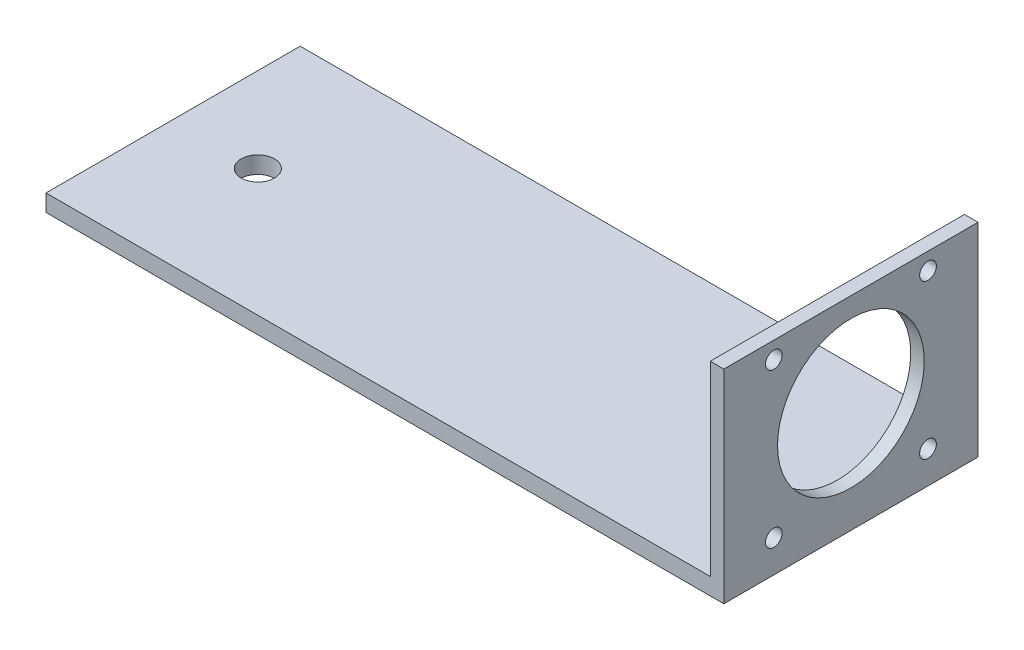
from build123d import *

# Parameters (mm, degrees)
SKETCH2_W           = 101.6
SKETCH2_H           = 38.1
BOSS_EXTRUDE1_DEPTH = 2.54
SKETCH3_W           = 38.1
SKETCH3_H           = 30.48
BOSS_EXTRUDE2_DEPTH = 2.032
SKETCH4_R           = 10.9982
CUT_EXTRUDE1_DEPTH  = 2.032
SKETCH6_R           = 2.5
CUT_EXTRUDE2_DEPTH  = 113.048264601
CUT_EXTRUDE3_REACH  = 112.88
SKETCH5_R           = 1.24968


with BuildPart() as part:
    # Sketch2 → Boss-Extrude1 (new body)
    with BuildSketch(Plane(origin=(0, 0, 0), x_dir=(1, 0, 0), z_dir=(0, 1, 0))):
        with Locations((50.8, 19.05)):
            Rectangle(SKETCH2_W, SKETCH2_H)
    extrude(amount=BOSS_EXTRUDE1_DEPTH)

    # Sketch3 → Boss-Extrude2 (add)
    with BuildSketch(Plane(origin=(101.6, 0, 0), x_dir=(0, 0, -1), z_dir=(1, 0, 0))):
        with Locations((19.05, 15.24)):
            Rectangle(SKETCH3_W, SKETCH3_H)
    extrude(amount=-BOSS_EXTRUDE2_DEPTH)

    # Sketch4 → Cut-Extrude1 (cut)
    with BuildSketch(Plane.ZY.offset(-99.568)):
        with Locations((-19.05, 16.51)):
            Circle(SKETCH4_R)
    extrude(amount=-CUT_EXTRUDE1_DEPTH, mode=Mode.SUBTRACT)

    # Sketch6 → Cut-Extrude2 (cut, through all)
    with BuildSketch(Plane(origin=(0, 2.54, 0), x_dir=(1, 0, 0), z_dir=(0, 1, 0))):
        with Locations(Location((12.7, 19.05, 0), (0, 0, 270))):
            Circle(SKETCH6_R)
    extrude(amount=-CUT_EXTRUDE2_DEPTH, mode=Mode.SUBTRACT)

    # Sketch5 → Cut-Extrude3 (cut, up to next)
    with BuildSketch(Plane.ZY.offset(-99.568), mode=Mode.PRIVATE) as cut_extrude3_sk1:
        with Locations((-30.607, 27.94)):
            Circle(SKETCH5_R)
    cut_extrude3_tool1 = extrude(cut_extrude3_sk1.sketch, amount=-CUT_EXTRUDE3_REACH, mode=Mode.PRIVATE) & part.part
    # Sketch5 → Cut-Extrude3 (cut, up to next)
    with BuildSketch(Plane.ZY.offset(-99.568), mode=Mode.PRIVATE) as cut_extrude3_sk2:
        with Locations((-7.493, 27.94)):
            Circle(SKETCH5_R)
    cut_extrude3_tool2 = extrude(cut_extrude3_sk2.sketch, amount=-CUT_EXTRUDE3_REACH, mode=Mode.PRIVATE) & part.part
    # Sketch5 → Cut-Extrude3 (cut, up to next)
    with BuildSketch(Plane.ZY.offset(-99.568), mode=Mode.PRIVATE) as cut_extrude3_sk3:
        with Locations((-7.493, 4.826)):
            Circle(SKETCH5_R)
    cut_extrude3_tool3 = extrude(cut_extrude3_sk3.sketch, amount=-CUT_EXTRUDE3_REACH, mode=Mode.PRIVATE) & part.part
    # Sketch5 → Cut-Extrude3 (cut, up to next)
    with BuildSketch(Plane.ZY.offset(-99.568), mode=Mode.PRIVATE) as cut_extrude3_sk4:
        with Locations((-30.607, 4.826)):
            Circle(SKETCH5_R)
    cut_extrude3_tool4 = extrude(cut_extrude3_sk4.sketch, amount=-CUT_EXTRUDE3_REACH, mode=Mode.PRIVATE) & part.part
    add(cut_extrude3_tool1.solids().sort_by_distance((99.568, 27.94, -30.607))[0], mode=Mode.SUBTRACT)
    add(cut_extrude3_tool2.solids().sort_by_distance((99.568, 27.94, -7.493))[0], mode=Mode.SUBTRACT)
    add(cut_extrude3_tool3.solids().sort_by_distance((99.568, 4.826, -7.493))[0], mode=Mode.SUBTRACT)
    add(cut_extrude3_tool4.solids().sort_by_distance((99.568, 4.826, -30.607))[0], mode=Mode.SUBTRACT)


solid = part.part
